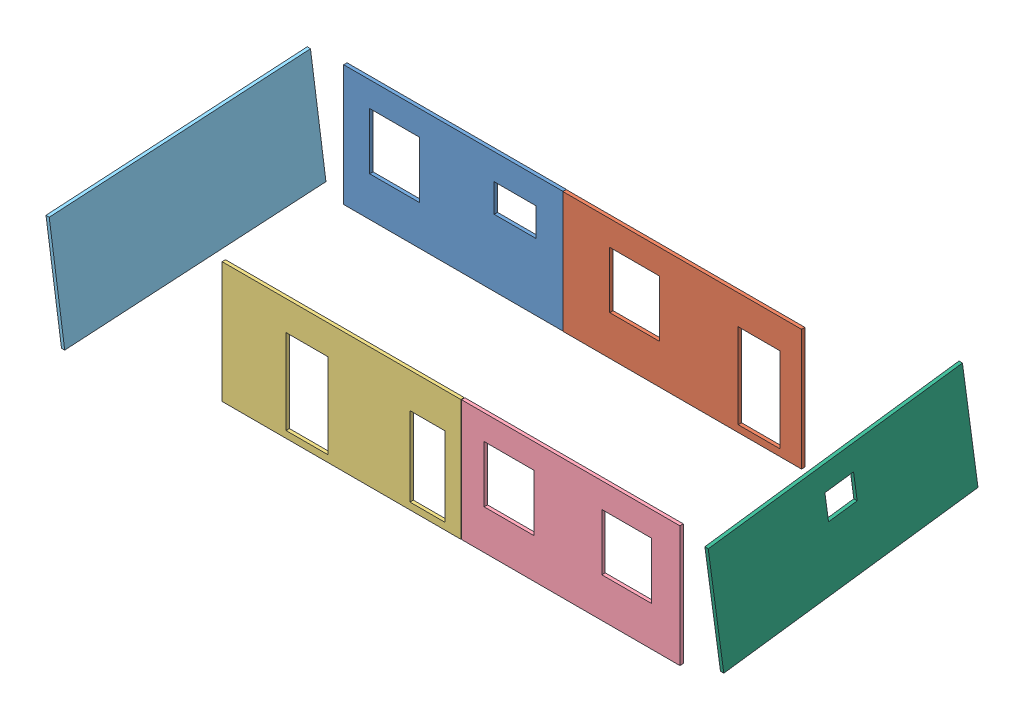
SolidWorks assembly Assemblage_av-ar.SLDASM, configuration Défaut (file format 3400). Lengths in mm.
Overall size (508.43 275.67 336.79).
8 component instances, 6 part files, 0 mates.
Components (placement in the parent):
- Assemblage_ar-1: Assemblage_ar.SLDASM [Défaut] at (69.1192 221.287 -44.2818) size (405.44 107.56 3.75)
  - doublage_AR-G-1: doublage_AR-G.SLDPRT [Défaut] at (-175.6761 -67.5433 -1.5) size (194 107 3)
  - doublage_AR-D-1: doublage_AR-D.SLDPRT [Défaut] at (18.7626 -66.9799 -0.75) size (211 107 3)
- Assemblage_av-1: Assemblage_av.SLDASM [Défaut] at (12.7175 70.6048 -9.4203) size (404.62 107.13 3)
  - doublage_AV-G-1: doublage_AV-G.SLDPRT [Défaut] at (-190.3343 -84.9678 0) size (211 107 3)
  - doublage_AV-D-1: doublage_AV-D.SLDPRT [Défaut] at (21.2894 -84.8365 0) size (193 107 3)
- doublage_G-1: doublage_G.SLDPRT [Défaut] at (-156.7685 223.8964 167.2261) x (0.0471 0.108001 -0.993034) z (-0.998675 -0.015546 -0.049059) size (222 107 3)
- doublage_D-1: doublage_D.SLDPRT [Défaut] at (327.3931 90.7538 -169.5035) x (-0.025327 -0.159799 0.986825) z (-0.999169 0.035594 -0.01988) size (222 107 3)
